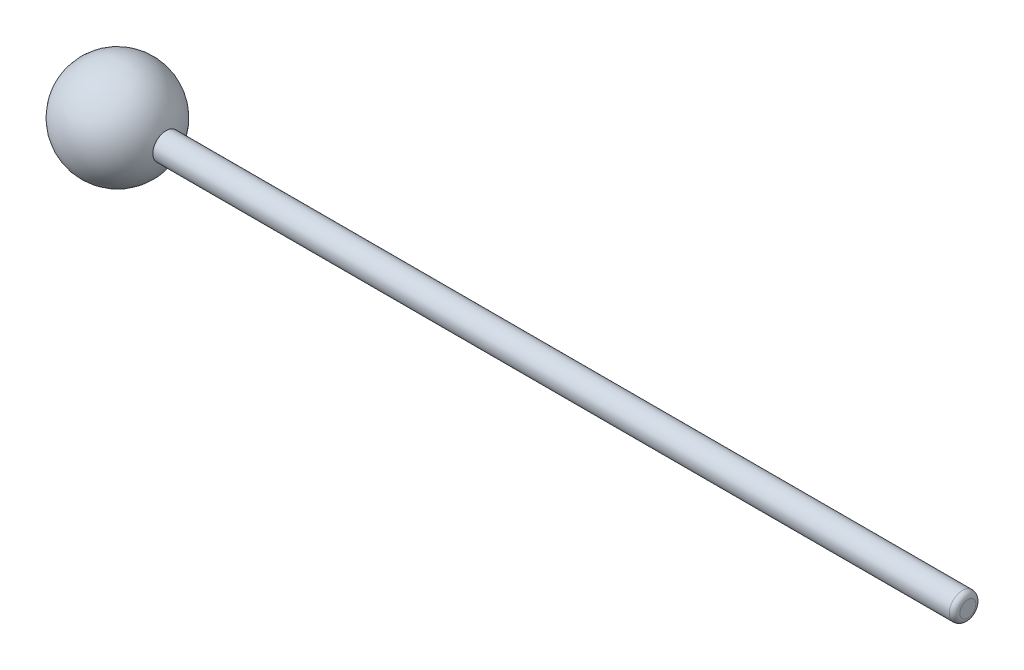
ISO-10303-21;
HEADER;
FILE_DESCRIPTION(('STEP AP214'),'2;1');
FILE_NAME('part.step','',(''),(''),'','','');
FILE_SCHEMA(('AUTOMOTIVE_DESIGN { 1 0 10303 214 1 1 1 1 }'));
ENDSEC;
DATA;
#1=APPLICATION_CONTEXT('core data for automotive mechanical design processes');
#2=APPLICATION_PROTOCOL_DEFINITION('international standard','automotive_design',2000,#1);
#3=PRODUCT_CONTEXT('',#1,'mechanical');
#4=PRODUCT('Part','Part','',(#3));
#5=PRODUCT_RELATED_PRODUCT_CATEGORY('part','',(#4));
#6=PRODUCT_DEFINITION_FORMATION('','',#4);
#7=PRODUCT_DEFINITION_CONTEXT('part definition',#1,'design');
#8=PRODUCT_DEFINITION('design','',#6,#7);
#9=PRODUCT_DEFINITION_SHAPE('','',#8);
#10=(LENGTH_UNIT() NAMED_UNIT(*) SI_UNIT(.MILLI.,.METRE.));
#11=(NAMED_UNIT(*) PLANE_ANGLE_UNIT() SI_UNIT($,.RADIAN.));
#12=(NAMED_UNIT(*) SI_UNIT($,.STERADIAN.) SOLID_ANGLE_UNIT());
#13=UNCERTAINTY_MEASURE_WITH_UNIT(LENGTH_MEASURE(1.E-05),#10,'distance_accuracy_value','');
#14=(GEOMETRIC_REPRESENTATION_CONTEXT(3) GLOBAL_UNCERTAINTY_ASSIGNED_CONTEXT((#13)) GLOBAL_UNIT_ASSIGNED_CONTEXT((#10,
#11,#12)) REPRESENTATION_CONTEXT('',''));
#15=CARTESIAN_POINT('',(0.,0.,0.));
#16=DIRECTION('',(0.,0.,1.));
#17=DIRECTION('',(1.,0.,0.));
#18=AXIS2_PLACEMENT_3D('',#15,#16,#17);
#19=CARTESIAN_POINT('',(160.,0.,0.));
#20=DIRECTION('',(-1.,0.,0.));
#21=DIRECTION('',(0.,0.,1.));
#22=AXIS2_PLACEMENT_3D('',#19,#20,#21);
#23=CYLINDRICAL_SURFACE('',#22,2.5);
#24=CARTESIAN_POINT('',(159.,0.,0.));
#25=DIRECTION('',(1.,0.,0.));
#26=DIRECTION('',(0.,0.,-1.));
#27=AXIS2_PLACEMENT_3D('',#24,#25,#26);
#28=CIRCLE('',#27,2.5);
#29=CARTESIAN_POINT('',(159.,0.,-2.5));
#30=VERTEX_POINT('',#29);
#31=EDGE_CURVE('E11',#30,#30,#28,.F.);
#32=ORIENTED_EDGE('',*,*,#31,.T.);
#33=EDGE_LOOP('',(#32));
#34=FACE_BOUND('',#33,.T.);
#35=CARTESIAN_POINT('',(0.,0.,0.));
#36=DIRECTION('',(1.,0.,0.));
#37=DIRECTION('',(0.,0.,-1.));
#38=AXIS2_PLACEMENT_3D('',#35,#36,#37);
#39=CIRCLE('',#38,2.5);
#40=CARTESIAN_POINT('',(0.,0.,-2.5));
#41=VERTEX_POINT('',#40);
#42=EDGE_CURVE('E58',#41,#41,#39,.T.);
#43=ORIENTED_EDGE('',*,*,#42,.T.);
#44=EDGE_LOOP('',(#43));
#45=FACE_BOUND('',#44,.T.);
#46=ADVANCED_FACE('F47',(#34,#45),#23,.T.);
#47=CARTESIAN_POINT('',(160.,0.,0.));
#48=DIRECTION('',(1.,0.,0.));
#49=DIRECTION('',(0.,0.,-1.));
#50=AXIS2_PLACEMENT_3D('',#47,#48,#49);
#51=PLANE('',#50);
#52=CARTESIAN_POINT('',(160.,0.,0.));
#53=DIRECTION('',(1.,0.,0.));
#54=DIRECTION('',(0.,0.,-1.));
#55=AXIS2_PLACEMENT_3D('',#52,#53,#54);
#56=CIRCLE('',#55,1.5);
#57=CARTESIAN_POINT('',(160.,0.,-1.5));
#58=VERTEX_POINT('',#57);
#59=EDGE_CURVE('E54',#58,#58,#56,.T.);
#60=ORIENTED_EDGE('',*,*,#59,.T.);
#61=EDGE_LOOP('',(#60));
#62=FACE_BOUND('',#61,.T.);
#63=ADVANCED_FACE('F68',(#62),#51,.T.);
#64=CARTESIAN_POINT('',(0.,0.,0.));
#65=DIRECTION('',(1.,0.,0.));
#66=DIRECTION('',(0.,0.,-1.));
#67=AXIS2_PLACEMENT_3D('',#64,#65,#66);
#68=PLANE('',#67);
#69=ORIENTED_EDGE('',*,*,#42,.F.);
#70=EDGE_LOOP('',(#69));
#71=FACE_BOUND('',#70,.T.);
#72=ADVANCED_FACE('F66',(#71),#68,.F.);
#73=CARTESIAN_POINT('',(159.,0.,0.));
#74=DIRECTION('',(1.,0.,0.));
#75=DIRECTION('',(0.,0.,-1.));
#76=AXIS2_PLACEMENT_3D('',#73,#74,#75);
#77=TOROIDAL_SURFACE('',#76,1.5,1.);
#78=ORIENTED_EDGE('',*,*,#31,.F.);
#79=EDGE_LOOP('',(#78));
#80=FACE_BOUND('',#79,.T.);
#81=ORIENTED_EDGE('',*,*,#59,.F.);
#82=EDGE_LOOP('',(#81));
#83=FACE_BOUND('',#82,.T.);
#84=ADVANCED_FACE('F49',(#80,#83),#77,.T.);
#85=CLOSED_SHELL('',(#46,#63,#72,#84));
#86=MANIFOLD_SOLID_BREP('B2',#85);
#87=CARTESIAN_POINT('',(0.,0.,0.));
#88=DIRECTION('',(1.,0.,0.));
#89=DIRECTION('',(0.,1.,0.));
#90=AXIS2_PLACEMENT_3D('',#87,#88,#89);
#91=PLANE('',#90);
#92=CARTESIAN_POINT('',(0.,0.,0.));
#93=DIRECTION('',(1.,0.,0.));
#94=DIRECTION('',(0.,1.,0.));
#95=AXIS2_PLACEMENT_3D('',#92,#93,#94);
#96=CIRCLE('',#95,2.5);
#97=CARTESIAN_POINT('',(0.,2.5,0.));
#98=VERTEX_POINT('',#97);
#99=EDGE_CURVE('E46',#98,#98,#96,.T.);
#100=ORIENTED_EDGE('',*,*,#99,.T.);
#101=EDGE_LOOP('',(#100));
#102=FACE_BOUND('',#101,.T.);
#103=ADVANCED_FACE('F103',(#102),#91,.T.);
#104=CARTESIAN_POINT('',(0.,0.,0.));
#105=DIRECTION('',(1.,0.,0.));
#106=DIRECTION('',(0.,1.,0.));
#107=AXIS2_PLACEMENT_3D('',#104,#105,#106);
#108=CYLINDRICAL_SURFACE('',#107,2.5);
#109=CARTESIAN_POINT('',(9.16515138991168,0.,0.));
#110=DIRECTION('',(1.,0.,0.));
#111=DIRECTION('',(0.,1.,0.));
#112=AXIS2_PLACEMENT_3D('',#109,#110,#111);
#113=CIRCLE('',#112,2.5);
#114=CARTESIAN_POINT('',(9.16515138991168,2.5,0.));
#115=VERTEX_POINT('',#114);
#116=EDGE_CURVE('E110',#115,#115,#113,.T.);
#117=ORIENTED_EDGE('',*,*,#116,.T.);
#118=EDGE_LOOP('',(#117));
#119=FACE_BOUND('',#118,.T.);
#120=ORIENTED_EDGE('',*,*,#99,.F.);
#121=EDGE_LOOP('',(#120));
#122=FACE_BOUND('',#121,.T.);
#123=ADVANCED_FACE('F117',(#119,#122),#108,.F.);
#124=CARTESIAN_POINT('',(0.,0.,0.));
#125=DIRECTION('',(1.,0.,0.));
#126=DIRECTION('',(0.,1.,0.));
#127=AXIS2_PLACEMENT_3D('',#124,#125,#126);
#128=SPHERICAL_SURFACE('',#127,9.5);
#129=ORIENTED_EDGE('',*,*,#116,.F.);
#130=EDGE_LOOP('',(#129));
#131=FACE_BOUND('',#130,.T.);
#132=ADVANCED_FACE('F120',(#131),#128,.T.);
#133=CLOSED_SHELL('',(#103,#123,#132));
#134=MANIFOLD_SOLID_BREP('B6',#133);
#135=ADVANCED_BREP_SHAPE_REPRESENTATION('',(#18,#86,#134),#14);
#136=SHAPE_DEFINITION_REPRESENTATION(#9,#135);
ENDSEC;
END-ISO-10303-21;
